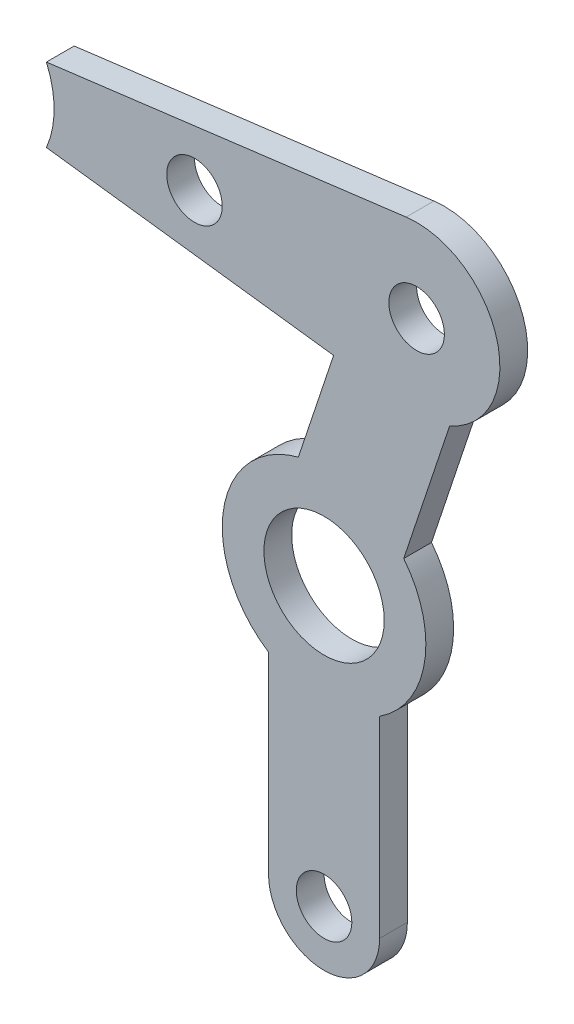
from build123d import *

# Parameters (mm, degrees)
ESQUISSE1_R             = 3.25
EXTRUSION1_DEPTH        = 1.5
EXTRUSION2_DEPTH        = 1.5
ESQUISSE2_R             = 1.5
ENL_V_MAT_EXTRU_1_DEPTH = 25.647515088


with BuildPart() as part:
    # Esquisse1 → Extrusion1 (new body)
    with BuildSketch(Plane.XY):
        with BuildLine():
            Line((3, -15), (3, -4.609772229))
            ThreePointArc((3, -4.609772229), (5.428981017, -0.881002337), (4.303787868, 3.424530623))
            Line((4.303787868, 3.424530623), (7.846049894, 14.051316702))
            ThreePointArc((7.846049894, 14.051316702), (5.948683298, 17.846049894), (2.153950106, 15.948683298))
            Line((2.153950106, 15.948683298), (-1.38831192, 5.321897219))
            ThreePointArc((-1.38831192, 5.321897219), (-5.428981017, 0.881002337), (-3, -4.609772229))
            Line((-3, -4.609772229), (-3, -15))
            ThreePointArc((-3, -15), (0, -18), (3, -15))
        make_face()
        Circle(ESQUISSE1_R, mode=Mode.SUBTRACT)
    extrude(amount=EXTRUSION1_DEPTH)

    # Esquisse4 → Extrusion2 (add)
    with BuildSketch(Plane.XY.offset(1.5)):
        with BuildLine():
            Line((4.433925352, 19.46425352), (-15, 17))
            ThreePointArc((-15, 17), (-14.582575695, 15), (-15, 13))
            Line((-15, 13), (4.433925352, 10.53574648))
            ThreePointArc((4.433925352, 10.53574648), (9.5, 15), (4.433925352, 19.46425352))
        make_face()
    extrude(amount=-EXTRUSION2_DEPTH)

    # Esquisse2 → Enl_v. mat.-Extru.1 (cut, through all)
    with BuildSketch(Plane.XY.offset(1.5)):
        with Locations((5, 15)):
            Circle(ESQUISSE2_R)
        with Locations((0, -15)):
            Circle(ESQUISSE2_R)
        with Locations((-7, 15)):
            Circle(ESQUISSE2_R)
    extrude(amount=-ENL_V_MAT_EXTRU_1_DEPTH, mode=Mode.SUBTRACT)


solid = part.part
